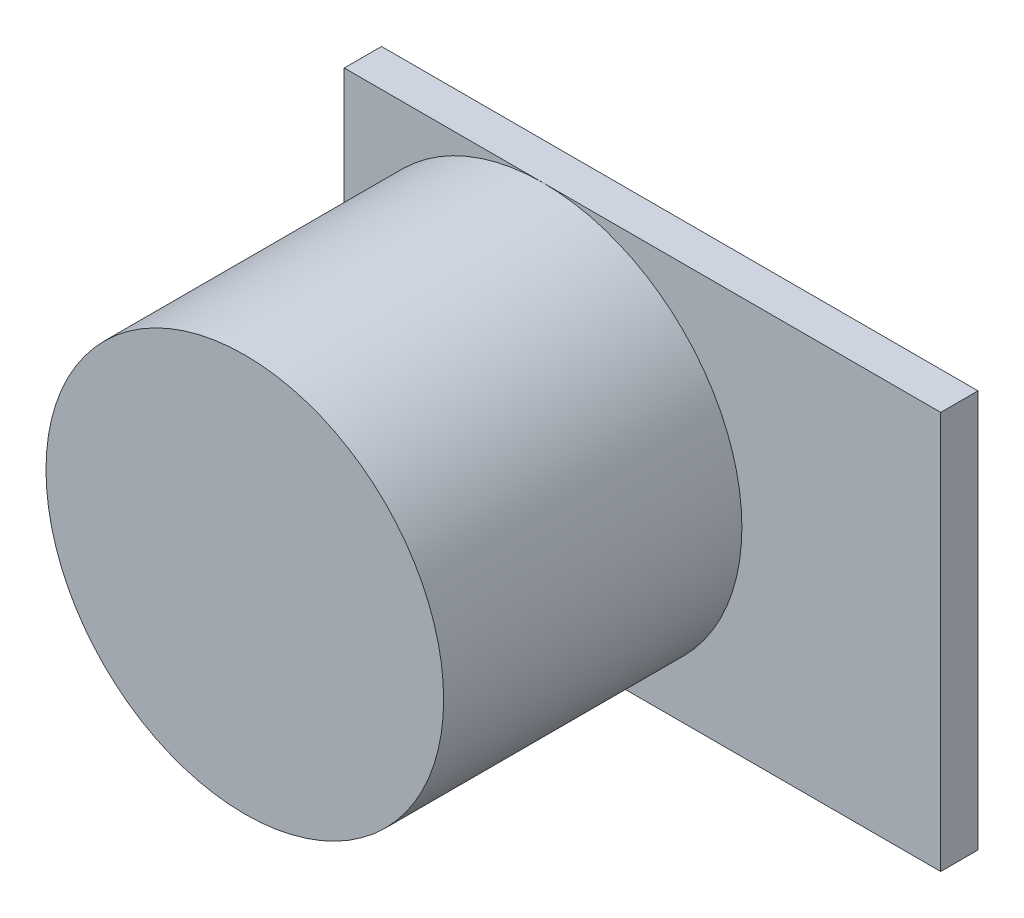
ISO-10303-21;
HEADER;
FILE_DESCRIPTION(('STEP AP214'),'2;1');
FILE_NAME('part.step','',(''),(''),'','','');
FILE_SCHEMA(('AUTOMOTIVE_DESIGN { 1 0 10303 214 1 1 1 1 }'));
ENDSEC;
DATA;
#1=APPLICATION_CONTEXT('core data for automotive mechanical design processes');
#2=APPLICATION_PROTOCOL_DEFINITION('international standard','automotive_design',2000,#1);
#3=PRODUCT_CONTEXT('',#1,'mechanical');
#4=PRODUCT('Part','Part','',(#3));
#5=PRODUCT_RELATED_PRODUCT_CATEGORY('part','',(#4));
#6=PRODUCT_DEFINITION_FORMATION('','',#4);
#7=PRODUCT_DEFINITION_CONTEXT('part definition',#1,'design');
#8=PRODUCT_DEFINITION('design','',#6,#7);
#9=PRODUCT_DEFINITION_SHAPE('','',#8);
#10=(LENGTH_UNIT() NAMED_UNIT(*) SI_UNIT(.MILLI.,.METRE.));
#11=(NAMED_UNIT(*) PLANE_ANGLE_UNIT() SI_UNIT($,.RADIAN.));
#12=(NAMED_UNIT(*) SI_UNIT($,.STERADIAN.) SOLID_ANGLE_UNIT());
#13=UNCERTAINTY_MEASURE_WITH_UNIT(LENGTH_MEASURE(1.E-05),#10,'distance_accuracy_value','');
#14=(GEOMETRIC_REPRESENTATION_CONTEXT(3) GLOBAL_UNCERTAINTY_ASSIGNED_CONTEXT((#13)) GLOBAL_UNIT_ASSIGNED_CONTEXT((#10,
#11,#12)) REPRESENTATION_CONTEXT('',''));
#15=CARTESIAN_POINT('',(0.,0.,0.));
#16=DIRECTION('',(0.,0.,1.));
#17=DIRECTION('',(1.,0.,0.));
#18=AXIS2_PLACEMENT_3D('',#15,#16,#17);
#19=CARTESIAN_POINT('',(0.,0.,120.));
#20=DIRECTION('',(0.,0.,-1.));
#21=DIRECTION('',(-1.,0.,0.));
#22=AXIS2_PLACEMENT_3D('',#19,#20,#21);
#23=CYLINDRICAL_SURFACE('',#22,80.);
#24=CARTESIAN_POINT('',(0.,0.,120.));
#25=DIRECTION('',(0.,0.,1.));
#26=DIRECTION('',(1.,0.,0.));
#27=AXIS2_PLACEMENT_3D('',#24,#25,#26);
#28=CIRCLE('',#27,80.);
#29=CARTESIAN_POINT('',(80.,0.,120.));
#30=VERTEX_POINT('',#29);
#31=EDGE_CURVE('E11',#30,#30,#28,.T.);
#32=ORIENTED_EDGE('',*,*,#31,.F.);
#33=EDGE_LOOP('',(#32));
#34=FACE_BOUND('',#33,.T.);
#35=CARTESIAN_POINT('',(0.,0.,0.));
#36=DIRECTION('',(0.,0.,1.));
#37=DIRECTION('',(1.,0.,0.));
#38=AXIS2_PLACEMENT_3D('',#35,#36,#37);
#39=CIRCLE('',#38,80.);
#40=CARTESIAN_POINT('',(0.,80.,0.));
#41=VERTEX_POINT('',#40);
#42=CARTESIAN_POINT('',(-80.,0.,0.));
#43=VERTEX_POINT('',#42);
#44=EDGE_CURVE('E36',#41,#43,#39,.T.);
#45=ORIENTED_EDGE('',*,*,#44,.T.);
#46=CARTESIAN_POINT('',(0.,-80.,0.));
#47=VERTEX_POINT('',#46);
#48=EDGE_CURVE('E51',#43,#47,#39,.T.);
#49=ORIENTED_EDGE('',*,*,#48,.T.);
#50=EDGE_CURVE('E85',#47,#41,#39,.T.);
#51=ORIENTED_EDGE('',*,*,#50,.T.);
#52=EDGE_LOOP('',(#45,#49,#51));
#53=FACE_BOUND('',#52,.T.);
#54=ADVANCED_FACE('F29',(#34,#53),#23,.T.);
#55=CARTESIAN_POINT('',(0.,0.,120.));
#56=DIRECTION('',(0.,0.,1.));
#57=DIRECTION('',(1.,0.,0.));
#58=AXIS2_PLACEMENT_3D('',#55,#56,#57);
#59=PLANE('',#58);
#60=ORIENTED_EDGE('',*,*,#31,.T.);
#61=EDGE_LOOP('',(#60));
#62=FACE_BOUND('',#61,.T.);
#63=ADVANCED_FACE('F128',(#62),#59,.T.);
#64=CARTESIAN_POINT('',(-80.,-80.,0.));
#65=DIRECTION('',(0.,0.,-1.));
#66=DIRECTION('',(-1.,0.,0.));
#67=AXIS2_PLACEMENT_3D('',#64,#65,#66);
#68=PLANE('',#67);
#69=ORIENTED_EDGE('',*,*,#44,.F.);
#70=DIRECTION('',(1.,0.,0.));
#71=VECTOR('',#70,1.);
#72=CARTESIAN_POINT('',(-80.,80.,0.));
#73=LINE('',#72,#71);
#74=CARTESIAN_POINT('',(-80.,80.,0.));
#75=VERTEX_POINT('',#74);
#76=EDGE_CURVE('E43',#75,#41,#73,.T.);
#77=ORIENTED_EDGE('',*,*,#76,.F.);
#78=DIRECTION('',(0.,-1.,0.));
#79=VECTOR('',#78,1.);
#80=CARTESIAN_POINT('',(-80.,80.,0.));
#81=LINE('',#80,#79);
#82=EDGE_CURVE('E109',#75,#43,#81,.T.);
#83=ORIENTED_EDGE('',*,*,#82,.T.);
#84=EDGE_LOOP('',(#69,#77,#83));
#85=FACE_BOUND('',#84,.T.);
#86=ADVANCED_FACE('F134',(#85),#68,.F.);
#87=ORIENTED_EDGE('',*,*,#48,.F.);
#88=CARTESIAN_POINT('',(-80.,-80.,0.));
#89=VERTEX_POINT('',#88);
#90=EDGE_CURVE('E108',#43,#89,#81,.T.);
#91=ORIENTED_EDGE('',*,*,#90,.T.);
#92=DIRECTION('',(1.,0.,0.));
#93=VECTOR('',#92,1.);
#94=CARTESIAN_POINT('',(-80.,-80.,0.));
#95=LINE('',#94,#93);
#96=EDGE_CURVE('E88',#89,#47,#95,.T.);
#97=ORIENTED_EDGE('',*,*,#96,.T.);
#98=EDGE_LOOP('',(#87,#91,#97));
#99=FACE_BOUND('',#98,.T.);
#100=ADVANCED_FACE('F139',(#99),#68,.F.);
#101=CARTESIAN_POINT('',(-80.,-80.,-15.));
#102=DIRECTION('',(0.,-1.,0.));
#103=DIRECTION('',(1.,0.,0.));
#104=AXIS2_PLACEMENT_3D('',#101,#102,#103);
#105=PLANE('',#104);
#106=ORIENTED_EDGE('',*,*,#96,.F.);
#107=DIRECTION('',(0.,0.,1.));
#108=VECTOR('',#107,1.);
#109=CARTESIAN_POINT('',(-80.,-80.,-15.));
#110=LINE('',#109,#108);
#111=CARTESIAN_POINT('',(-80.,-80.,-15.));
#112=VERTEX_POINT('',#111);
#113=EDGE_CURVE('E119',#112,#89,#110,.T.);
#114=ORIENTED_EDGE('',*,*,#113,.F.);
#115=DIRECTION('',(1.,0.,0.));
#116=VECTOR('',#115,1.);
#117=CARTESIAN_POINT('',(-80.,-80.,-15.));
#118=LINE('',#117,#116);
#119=CARTESIAN_POINT('',(160.,-80.,-15.));
#120=VERTEX_POINT('',#119);
#121=EDGE_CURVE('E95',#112,#120,#118,.T.);
#122=ORIENTED_EDGE('',*,*,#121,.T.);
#123=DIRECTION('',(0.,0.,1.));
#124=VECTOR('',#123,1.);
#125=CARTESIAN_POINT('',(160.,-80.,-15.));
#126=LINE('',#125,#124);
#127=CARTESIAN_POINT('',(160.,-80.,0.));
#128=VERTEX_POINT('',#127);
#129=EDGE_CURVE('E92',#120,#128,#126,.T.);
#130=ORIENTED_EDGE('',*,*,#129,.T.);
#131=EDGE_CURVE('E79',#47,#128,#95,.T.);
#132=ORIENTED_EDGE('',*,*,#131,.F.);
#133=EDGE_LOOP('',(#106,#114,#122,#130,#132));
#134=FACE_BOUND('',#133,.T.);
#135=ADVANCED_FACE('F93',(#134),#105,.T.);
#136=CARTESIAN_POINT('',(-80.,80.,-15.));
#137=DIRECTION('',(-1.,0.,0.));
#138=DIRECTION('',(0.,-1.,0.));
#139=AXIS2_PLACEMENT_3D('',#136,#137,#138);
#140=PLANE('',#139);
#141=ORIENTED_EDGE('',*,*,#82,.F.);
#142=DIRECTION('',(0.,0.,1.));
#143=VECTOR('',#142,1.);
#144=CARTESIAN_POINT('',(-80.,80.,-15.));
#145=LINE('',#144,#143);
#146=CARTESIAN_POINT('',(-80.,80.,-15.));
#147=VERTEX_POINT('',#146);
#148=EDGE_CURVE('E122',#147,#75,#145,.T.);
#149=ORIENTED_EDGE('',*,*,#148,.F.);
#150=DIRECTION('',(0.,-1.,0.));
#151=VECTOR('',#150,1.);
#152=CARTESIAN_POINT('',(-80.,80.,-15.));
#153=LINE('',#152,#151);
#154=EDGE_CURVE('E99',#147,#112,#153,.T.);
#155=ORIENTED_EDGE('',*,*,#154,.T.);
#156=ORIENTED_EDGE('',*,*,#113,.T.);
#157=ORIENTED_EDGE('',*,*,#90,.F.);
#158=EDGE_LOOP('',(#141,#149,#155,#156,#157));
#159=FACE_BOUND('',#158,.T.);
#160=ADVANCED_FACE('F145',(#159),#140,.T.);
#161=CARTESIAN_POINT('',(-80.,80.,-15.));
#162=DIRECTION('',(0.,-1.,0.));
#163=DIRECTION('',(1.,0.,0.));
#164=AXIS2_PLACEMENT_3D('',#161,#162,#163);
#165=PLANE('',#164);
#166=ORIENTED_EDGE('',*,*,#76,.T.);
#167=CARTESIAN_POINT('',(160.,80.,0.));
#168=VERTEX_POINT('',#167);
#169=EDGE_CURVE('E104',#41,#168,#73,.T.);
#170=ORIENTED_EDGE('',*,*,#169,.T.);
#171=DIRECTION('',(0.,0.,1.));
#172=VECTOR('',#171,1.);
#173=CARTESIAN_POINT('',(160.,80.,-15.));
#174=LINE('',#173,#172);
#175=CARTESIAN_POINT('',(160.,80.,-15.));
#176=VERTEX_POINT('',#175);
#177=EDGE_CURVE('E98',#176,#168,#174,.T.);
#178=ORIENTED_EDGE('',*,*,#177,.F.);
#179=DIRECTION('',(1.,0.,0.));
#180=VECTOR('',#179,1.);
#181=CARTESIAN_POINT('',(-80.,80.,-15.));
#182=LINE('',#181,#180);
#183=EDGE_CURVE('E115',#147,#176,#182,.T.);
#184=ORIENTED_EDGE('',*,*,#183,.F.);
#185=ORIENTED_EDGE('',*,*,#148,.T.);
#186=EDGE_LOOP('',(#166,#170,#178,#184,#185));
#187=FACE_BOUND('',#186,.T.);
#188=ADVANCED_FACE('F149',(#187),#165,.F.);
#189=CARTESIAN_POINT('',(160.,80.,-15.));
#190=DIRECTION('',(-1.,0.,0.));
#191=DIRECTION('',(0.,-1.,0.));
#192=AXIS2_PLACEMENT_3D('',#189,#190,#191);
#193=PLANE('',#192);
#194=DIRECTION('',(0.,-1.,0.));
#195=VECTOR('',#194,1.);
#196=CARTESIAN_POINT('',(160.,80.,0.));
#197=LINE('',#196,#195);
#198=EDGE_CURVE('E83',#168,#128,#197,.T.);
#199=ORIENTED_EDGE('',*,*,#198,.T.);
#200=ORIENTED_EDGE('',*,*,#129,.F.);
#201=DIRECTION('',(0.,-1.,0.));
#202=VECTOR('',#201,1.);
#203=CARTESIAN_POINT('',(160.,80.,-15.));
#204=LINE('',#203,#202);
#205=EDGE_CURVE('E113',#176,#120,#204,.T.);
#206=ORIENTED_EDGE('',*,*,#205,.F.);
#207=ORIENTED_EDGE('',*,*,#177,.T.);
#208=EDGE_LOOP('',(#199,#200,#206,#207));
#209=FACE_BOUND('',#208,.T.);
#210=ADVANCED_FACE('F102',(#209),#193,.F.);
#211=CARTESIAN_POINT('',(-80.,-80.,-15.));
#212=DIRECTION('',(0.,0.,-1.));
#213=DIRECTION('',(-1.,0.,0.));
#214=AXIS2_PLACEMENT_3D('',#211,#212,#213);
#215=PLANE('',#214);
#216=ORIENTED_EDGE('',*,*,#121,.F.);
#217=ORIENTED_EDGE('',*,*,#154,.F.);
#218=ORIENTED_EDGE('',*,*,#183,.T.);
#219=ORIENTED_EDGE('',*,*,#205,.T.);
#220=EDGE_LOOP('',(#216,#217,#218,#219));
#221=FACE_BOUND('',#220,.T.);
#222=ADVANCED_FACE('F148',(#221),#215,.T.);
#223=ORIENTED_EDGE('',*,*,#50,.F.);
#224=ORIENTED_EDGE('',*,*,#131,.T.);
#225=ORIENTED_EDGE('',*,*,#198,.F.);
#226=ORIENTED_EDGE('',*,*,#169,.F.);
#227=EDGE_LOOP('',(#223,#224,#225,#226));
#228=FACE_BOUND('',#227,.T.);
#229=ADVANCED_FACE('F81',(#228),#68,.F.);
#230=CLOSED_SHELL('',(#54,#63,#86,#100,#135,#160,#188,#210,#222,#229));
#231=MANIFOLD_SOLID_BREP('B2',#230);
#232=ADVANCED_BREP_SHAPE_REPRESENTATION('',(#18,#231),#14);
#233=SHAPE_DEFINITION_REPRESENTATION(#9,#232);
ENDSEC;
END-ISO-10303-21;
